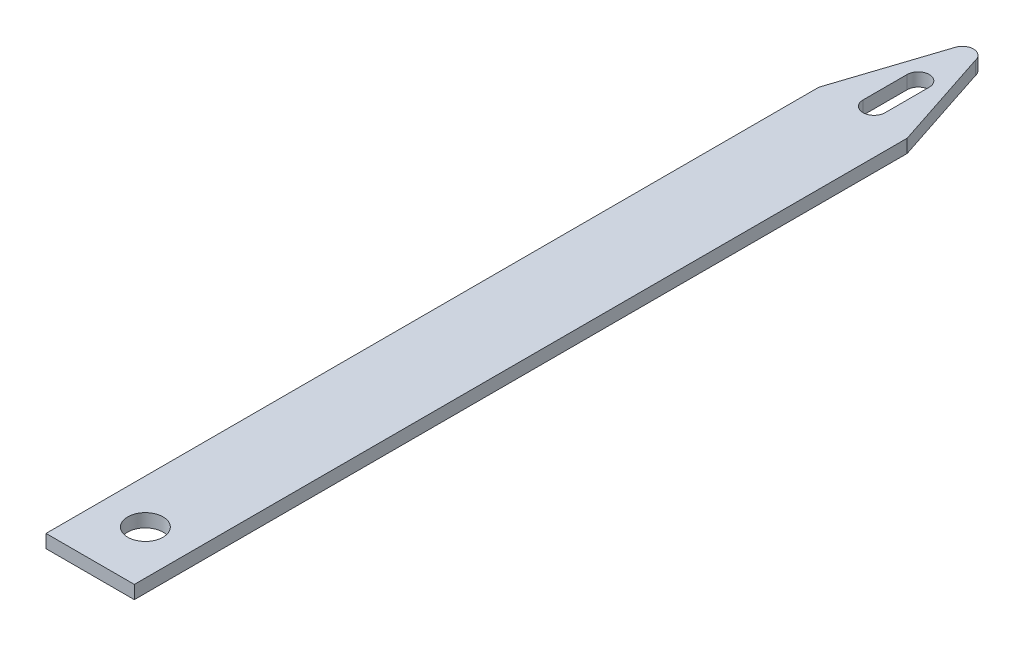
ISO-10303-21;
HEADER;
FILE_DESCRIPTION(('STEP AP214'),'2;1');
FILE_NAME('part.step','',(''),(''),'','','');
FILE_SCHEMA(('AUTOMOTIVE_DESIGN { 1 0 10303 214 1 1 1 1 }'));
ENDSEC;
DATA;
#1=APPLICATION_CONTEXT('core data for automotive mechanical design processes');
#2=APPLICATION_PROTOCOL_DEFINITION('international standard','automotive_design',2000,#1);
#3=PRODUCT_CONTEXT('',#1,'mechanical');
#4=PRODUCT('Part','Part','',(#3));
#5=PRODUCT_RELATED_PRODUCT_CATEGORY('part','',(#4));
#6=PRODUCT_DEFINITION_FORMATION('','',#4);
#7=PRODUCT_DEFINITION_CONTEXT('part definition',#1,'design');
#8=PRODUCT_DEFINITION('design','',#6,#7);
#9=PRODUCT_DEFINITION_SHAPE('','',#8);
#10=(LENGTH_UNIT() NAMED_UNIT(*) SI_UNIT(.MILLI.,.METRE.));
#11=(NAMED_UNIT(*) PLANE_ANGLE_UNIT() SI_UNIT($,.RADIAN.));
#12=(NAMED_UNIT(*) SI_UNIT($,.STERADIAN.) SOLID_ANGLE_UNIT());
#13=UNCERTAINTY_MEASURE_WITH_UNIT(LENGTH_MEASURE(1.E-05),#10,'distance_accuracy_value','');
#14=(GEOMETRIC_REPRESENTATION_CONTEXT(3) GLOBAL_UNCERTAINTY_ASSIGNED_CONTEXT((#13)) GLOBAL_UNIT_ASSIGNED_CONTEXT((#10,
#11,#12)) REPRESENTATION_CONTEXT('',''));
#15=CARTESIAN_POINT('',(0.,0.,0.));
#16=DIRECTION('',(0.,0.,1.));
#17=DIRECTION('',(1.,0.,0.));
#18=AXIS2_PLACEMENT_3D('',#15,#16,#17);
#19=CARTESIAN_POINT('',(0.,0.6,-20.));
#20=DIRECTION('',(0.,1.,0.));
#21=DIRECTION('',(0.,0.,1.));
#22=AXIS2_PLACEMENT_3D('',#19,#20,#21);
#23=PLANE('',#22);
#24=CARTESIAN_POINT('',(2.,0.6,-19.5));
#25=DIRECTION('',(0.,-1.,0.));
#26=DIRECTION('',(0.,0.,-1.));
#27=AXIS2_PLACEMENT_3D('',#24,#25,#26);
#28=CIRCLE('',#27,0.5);
#29=CARTESIAN_POINT('',(1.52483695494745,0.6,-19.6556280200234));
#30=VERTEX_POINT('',#29);
#31=CARTESIAN_POINT('',(2.4903123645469,0.6,-19.5979478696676));
#32=VERTEX_POINT('',#31);
#33=EDGE_CURVE('E229',#30,#32,#28,.T.);
#34=ORIENTED_EDGE('',*,*,#33,.F.);
#35=DIRECTION('',(-0.311256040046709,0.,0.950326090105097));
#36=VECTOR('',#35,1.);
#37=CARTESIAN_POINT('',(5.04754408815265,0.6,-30.4111478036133));
#38=LINE('',#37,#36);
#39=CARTESIAN_POINT('',(0.,0.6,-15.));
#40=VERTEX_POINT('',#39);
#41=EDGE_CURVE('E216',#30,#40,#38,.T.);
#42=ORIENTED_EDGE('',*,*,#41,.T.);
#43=DIRECTION('',(0.,0.,1.));
#44=VECTOR('',#43,1.);
#45=CARTESIAN_POINT('',(0.,0.6,-20.));
#46=LINE('',#45,#44);
#47=CARTESIAN_POINT('',(0.,0.6,20.));
#48=VERTEX_POINT('',#47);
#49=EDGE_CURVE('E12',#40,#48,#46,.T.);
#50=ORIENTED_EDGE('',*,*,#49,.T.);
#51=DIRECTION('',(-1.,0.,0.));
#52=VECTOR('',#51,1.);
#53=CARTESIAN_POINT('',(0.,0.6,20.));
#54=LINE('',#53,#52);
#55=CARTESIAN_POINT('',(4.,0.6,20.));
#56=VERTEX_POINT('',#55);
#57=EDGE_CURVE('E260',#56,#48,#54,.T.);
#58=ORIENTED_EDGE('',*,*,#57,.F.);
#59=DIRECTION('',(0.,0.,1.));
#60=VECTOR('',#59,1.);
#61=CARTESIAN_POINT('',(4.,0.6,-20.));
#62=LINE('',#61,#60);
#63=CARTESIAN_POINT('',(4.,0.6,-15.));
#64=VERTEX_POINT('',#63);
#65=EDGE_CURVE('E116',#64,#56,#62,.T.);
#66=ORIENTED_EDGE('',*,*,#65,.F.);
#67=DIRECTION('',(0.311954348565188,0.,0.95009709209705));
#68=VECTOR('',#67,1.);
#69=CARTESIAN_POINT('',(-1.05813179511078,0.6,-30.405190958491));
#70=LINE('',#69,#68);
#71=EDGE_CURVE('E234',#32,#64,#70,.T.);
#72=ORIENTED_EDGE('',*,*,#71,.F.);
#73=EDGE_LOOP('',(#34,#42,#50,#58,#66,#72));
#74=FACE_BOUND('',#73,.T.);
#75=CARTESIAN_POINT('',(2.,0.6,17.5));
#76=DIRECTION('',(0.,-1.,0.));
#77=DIRECTION('',(0.,0.,-1.));
#78=AXIS2_PLACEMENT_3D('',#75,#76,#77);
#79=CIRCLE('',#78,0.8);
#80=CARTESIAN_POINT('',(2.,0.6,16.7));
#81=VERTEX_POINT('',#80);
#82=EDGE_CURVE('E244',#81,#81,#79,.T.);
#83=ORIENTED_EDGE('',*,*,#82,.T.);
#84=EDGE_LOOP('',(#83));
#85=FACE_BOUND('',#84,.T.);
#86=DIRECTION('',(0.,0.,1.));
#87=VECTOR('',#86,1.);
#88=CARTESIAN_POINT('',(2.5,0.6,-31.4092962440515));
#89=LINE('',#88,#87);
#90=CARTESIAN_POINT('',(2.5,0.6,-17.5));
#91=VERTEX_POINT('',#90);
#92=CARTESIAN_POINT('',(2.5,0.6,-15.5));
#93=VERTEX_POINT('',#92);
#94=EDGE_CURVE('E210',#91,#93,#89,.T.);
#95=ORIENTED_EDGE('',*,*,#94,.T.);
#96=CARTESIAN_POINT('',(2.,0.6,-15.5));
#97=DIRECTION('',(0.,-1.,0.));
#98=DIRECTION('',(0.,0.,-1.));
#99=AXIS2_PLACEMENT_3D('',#96,#97,#98);
#100=CIRCLE('',#99,0.5);
#101=CARTESIAN_POINT('',(1.5,0.6,-15.5));
#102=VERTEX_POINT('',#101);
#103=EDGE_CURVE('E124',#93,#102,#100,.T.);
#104=ORIENTED_EDGE('',*,*,#103,.T.);
#105=DIRECTION('',(0.,0.,1.));
#106=VECTOR('',#105,1.);
#107=CARTESIAN_POINT('',(1.5,0.6,-31.4092962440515));
#108=LINE('',#107,#106);
#109=CARTESIAN_POINT('',(1.5,0.6,-17.5));
#110=VERTEX_POINT('',#109);
#111=EDGE_CURVE('E201',#110,#102,#108,.T.);
#112=ORIENTED_EDGE('',*,*,#111,.F.);
#113=CARTESIAN_POINT('',(2.,0.6,-17.5));
#114=DIRECTION('',(0.,-1.,0.));
#115=DIRECTION('',(0.,0.,-1.));
#116=AXIS2_PLACEMENT_3D('',#113,#114,#115);
#117=CIRCLE('',#116,0.5);
#118=EDGE_CURVE('E204',#110,#91,#117,.T.);
#119=ORIENTED_EDGE('',*,*,#118,.T.);
#120=EDGE_LOOP('',(#95,#104,#112,#119));
#121=FACE_BOUND('',#120,.T.);
#122=ADVANCED_FACE('F107',(#74,#85,#121),#23,.T.);
#123=CARTESIAN_POINT('',(0.,0.,-20.));
#124=DIRECTION('',(0.,-1.,0.));
#125=DIRECTION('',(0.,0.,-1.));
#126=AXIS2_PLACEMENT_3D('',#123,#124,#125);
#127=PLANE('',#126);
#128=DIRECTION('',(0.,0.,1.));
#129=VECTOR('',#128,1.);
#130=CARTESIAN_POINT('',(0.,0.,-20.));
#131=LINE('',#130,#129);
#132=CARTESIAN_POINT('',(0.,0.,-15.));
#133=VERTEX_POINT('',#132);
#134=CARTESIAN_POINT('',(0.,0.,20.));
#135=VERTEX_POINT('',#134);
#136=EDGE_CURVE('E111',#133,#135,#131,.T.);
#137=ORIENTED_EDGE('',*,*,#136,.F.);
#138=DIRECTION('',(-0.311256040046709,0.,0.950326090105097));
#139=VECTOR('',#138,1.);
#140=CARTESIAN_POINT('',(5.04754408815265,0.,-30.4111478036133));
#141=LINE('',#140,#139);
#142=CARTESIAN_POINT('',(1.52483695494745,0.,-19.6556280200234));
#143=VERTEX_POINT('',#142);
#144=EDGE_CURVE('E225',#143,#133,#141,.T.);
#145=ORIENTED_EDGE('',*,*,#144,.F.);
#146=CARTESIAN_POINT('',(2.,0.,-19.5));
#147=DIRECTION('',(0.,-1.,0.));
#148=DIRECTION('',(0.,0.,-1.));
#149=AXIS2_PLACEMENT_3D('',#146,#147,#148);
#150=CIRCLE('',#149,0.5);
#151=CARTESIAN_POINT('',(2.4903123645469,0.,-19.5979478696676));
#152=VERTEX_POINT('',#151);
#153=EDGE_CURVE('E230',#143,#152,#150,.T.);
#154=ORIENTED_EDGE('',*,*,#153,.T.);
#155=DIRECTION('',(0.311954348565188,0.,0.95009709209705));
#156=VECTOR('',#155,1.);
#157=CARTESIAN_POINT('',(-1.05813179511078,0.,-30.405190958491));
#158=LINE('',#157,#156);
#159=CARTESIAN_POINT('',(4.,0.,-15.));
#160=VERTEX_POINT('',#159);
#161=EDGE_CURVE('E233',#152,#160,#158,.T.);
#162=ORIENTED_EDGE('',*,*,#161,.T.);
#163=DIRECTION('',(0.,0.,1.));
#164=VECTOR('',#163,1.);
#165=CARTESIAN_POINT('',(4.,0.,-20.));
#166=LINE('',#165,#164);
#167=CARTESIAN_POINT('',(4.,0.,20.));
#168=VERTEX_POINT('',#167);
#169=EDGE_CURVE('E263',#160,#168,#166,.T.);
#170=ORIENTED_EDGE('',*,*,#169,.T.);
#171=DIRECTION('',(1.,0.,0.));
#172=VECTOR('',#171,1.);
#173=CARTESIAN_POINT('',(0.,0.,20.));
#174=LINE('',#173,#172);
#175=EDGE_CURVE('E254',#135,#168,#174,.T.);
#176=ORIENTED_EDGE('',*,*,#175,.F.);
#177=EDGE_LOOP('',(#137,#145,#154,#162,#170,#176));
#178=FACE_BOUND('',#177,.T.);
#179=CARTESIAN_POINT('',(2.,0.,17.5));
#180=DIRECTION('',(0.,-1.,0.));
#181=DIRECTION('',(0.,0.,-1.));
#182=AXIS2_PLACEMENT_3D('',#179,#180,#181);
#183=CIRCLE('',#182,0.8);
#184=CARTESIAN_POINT('',(2.,0.,16.7));
#185=VERTEX_POINT('',#184);
#186=EDGE_CURVE('E246',#185,#185,#183,.T.);
#187=ORIENTED_EDGE('',*,*,#186,.F.);
#188=EDGE_LOOP('',(#187));
#189=FACE_BOUND('',#188,.T.);
#190=DIRECTION('',(0.,0.,1.));
#191=VECTOR('',#190,1.);
#192=CARTESIAN_POINT('',(1.5,0.,-31.4092962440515));
#193=LINE('',#192,#191);
#194=CARTESIAN_POINT('',(1.5,0.,-17.5));
#195=VERTEX_POINT('',#194);
#196=CARTESIAN_POINT('',(1.5,0.,-15.5));
#197=VERTEX_POINT('',#196);
#198=EDGE_CURVE('E196',#195,#197,#193,.T.);
#199=ORIENTED_EDGE('',*,*,#198,.T.);
#200=CARTESIAN_POINT('',(2.,0.,-15.5));
#201=DIRECTION('',(0.,-1.,0.));
#202=DIRECTION('',(0.,0.,-1.));
#203=AXIS2_PLACEMENT_3D('',#200,#201,#202);
#204=CIRCLE('',#203,0.5);
#205=CARTESIAN_POINT('',(2.5,0.,-15.5));
#206=VERTEX_POINT('',#205);
#207=EDGE_CURVE('E192',#206,#197,#204,.T.);
#208=ORIENTED_EDGE('',*,*,#207,.F.);
#209=DIRECTION('',(0.,0.,1.));
#210=VECTOR('',#209,1.);
#211=CARTESIAN_POINT('',(2.5,0.,-31.4092962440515));
#212=LINE('',#211,#210);
#213=CARTESIAN_POINT('',(2.5,0.,-17.5));
#214=VERTEX_POINT('',#213);
#215=EDGE_CURVE('E184',#214,#206,#212,.T.);
#216=ORIENTED_EDGE('',*,*,#215,.F.);
#217=CARTESIAN_POINT('',(2.,0.,-17.5));
#218=DIRECTION('',(0.,-1.,0.));
#219=DIRECTION('',(0.,0.,-1.));
#220=AXIS2_PLACEMENT_3D('',#217,#218,#219);
#221=CIRCLE('',#220,0.5);
#222=EDGE_CURVE('E191',#195,#214,#221,.T.);
#223=ORIENTED_EDGE('',*,*,#222,.F.);
#224=EDGE_LOOP('',(#199,#208,#216,#223));
#225=FACE_BOUND('',#224,.T.);
#226=ADVANCED_FACE('F199',(#178,#189,#225),#127,.T.);
#227=CARTESIAN_POINT('',(0.,0.,-20.));
#228=DIRECTION('',(-1.,0.,0.));
#229=DIRECTION('',(0.,0.,1.));
#230=AXIS2_PLACEMENT_3D('',#227,#228,#229);
#231=PLANE('',#230);
#232=ORIENTED_EDGE('',*,*,#49,.F.);
#233=DIRECTION('',(0.,1.,0.));
#234=VECTOR('',#233,1.);
#235=CARTESIAN_POINT('',(0.,0.,-15.));
#236=LINE('',#235,#234);
#237=EDGE_CURVE('E223',#133,#40,#236,.T.);
#238=ORIENTED_EDGE('',*,*,#237,.F.);
#239=ORIENTED_EDGE('',*,*,#136,.T.);
#240=DIRECTION('',(0.,-1.,0.));
#241=VECTOR('',#240,1.);
#242=CARTESIAN_POINT('',(0.,0.,20.));
#243=LINE('',#242,#241);
#244=EDGE_CURVE('E249',#48,#135,#243,.T.);
#245=ORIENTED_EDGE('',*,*,#244,.F.);
#246=EDGE_LOOP('',(#232,#238,#239,#245));
#247=FACE_BOUND('',#246,.T.);
#248=ADVANCED_FACE('F109',(#247),#231,.T.);
#249=CARTESIAN_POINT('',(4.,0.,-20.));
#250=DIRECTION('',(1.,0.,0.));
#251=DIRECTION('',(0.,0.,-1.));
#252=AXIS2_PLACEMENT_3D('',#249,#250,#251);
#253=PLANE('',#252);
#254=DIRECTION('',(0.,1.,0.));
#255=VECTOR('',#254,1.);
#256=CARTESIAN_POINT('',(4.,0.,-15.));
#257=LINE('',#256,#255);
#258=EDGE_CURVE('E241',#160,#64,#257,.T.);
#259=ORIENTED_EDGE('',*,*,#258,.T.);
#260=ORIENTED_EDGE('',*,*,#65,.T.);
#261=DIRECTION('',(0.,1.,0.));
#262=VECTOR('',#261,1.);
#263=CARTESIAN_POINT('',(4.,0.,20.));
#264=LINE('',#263,#262);
#265=EDGE_CURVE('E257',#168,#56,#264,.T.);
#266=ORIENTED_EDGE('',*,*,#265,.F.);
#267=ORIENTED_EDGE('',*,*,#169,.F.);
#268=EDGE_LOOP('',(#259,#260,#266,#267));
#269=FACE_BOUND('',#268,.T.);
#270=ADVANCED_FACE('F292',(#269),#253,.T.);
#271=CARTESIAN_POINT('',(0.,0.6,20.));
#272=DIRECTION('',(0.,0.,-1.));
#273=DIRECTION('',(-1.,0.,0.));
#274=AXIS2_PLACEMENT_3D('',#271,#272,#273);
#275=PLANE('',#274);
#276=ORIENTED_EDGE('',*,*,#244,.T.);
#277=ORIENTED_EDGE('',*,*,#175,.T.);
#278=ORIENTED_EDGE('',*,*,#265,.T.);
#279=ORIENTED_EDGE('',*,*,#57,.T.);
#280=EDGE_LOOP('',(#276,#277,#278,#279));
#281=FACE_BOUND('',#280,.T.);
#282=ADVANCED_FACE('F276',(#281),#275,.F.);
#283=CARTESIAN_POINT('',(2.,0.,17.5));
#284=DIRECTION('',(0.,1.,0.));
#285=DIRECTION('',(0.,0.,1.));
#286=AXIS2_PLACEMENT_3D('',#283,#284,#285);
#287=CYLINDRICAL_SURFACE('',#286,0.8);
#288=ORIENTED_EDGE('',*,*,#186,.T.);
#289=EDGE_LOOP('',(#288));
#290=FACE_BOUND('',#289,.T.);
#291=ORIENTED_EDGE('',*,*,#82,.F.);
#292=EDGE_LOOP('',(#291));
#293=FACE_BOUND('',#292,.T.);
#294=ADVANCED_FACE('F299',(#290,#293),#287,.F.);
#295=CARTESIAN_POINT('',(-1.05813179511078,0.,-30.405190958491));
#296=DIRECTION('',(-0.950097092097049,0.,0.311954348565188));
#297=DIRECTION('',(0.311954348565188,0.,0.95009709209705));
#298=AXIS2_PLACEMENT_3D('',#295,#296,#297);
#299=PLANE('',#298);
#300=ORIENTED_EDGE('',*,*,#71,.T.);
#301=ORIENTED_EDGE('',*,*,#258,.F.);
#302=ORIENTED_EDGE('',*,*,#161,.F.);
#303=DIRECTION('',(0.,1.,0.));
#304=VECTOR('',#303,1.);
#305=CARTESIAN_POINT('',(2.4903123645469,0.,-19.5979478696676));
#306=LINE('',#305,#304);
#307=EDGE_CURVE('E237',#152,#32,#306,.T.);
#308=ORIENTED_EDGE('',*,*,#307,.T.);
#309=EDGE_LOOP('',(#300,#301,#302,#308));
#310=FACE_BOUND('',#309,.T.);
#311=ADVANCED_FACE('F290',(#310),#299,.F.);
#312=CARTESIAN_POINT('',(2.,0.,-19.5));
#313=DIRECTION('',(0.,1.,0.));
#314=DIRECTION('',(0.,0.,1.));
#315=AXIS2_PLACEMENT_3D('',#312,#313,#314);
#316=CYLINDRICAL_SURFACE('',#315,0.5);
#317=ORIENTED_EDGE('',*,*,#33,.T.);
#318=ORIENTED_EDGE('',*,*,#307,.F.);
#319=ORIENTED_EDGE('',*,*,#153,.F.);
#320=DIRECTION('',(0.,1.,0.));
#321=VECTOR('',#320,1.);
#322=CARTESIAN_POINT('',(1.52483695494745,0.,-19.6556280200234));
#323=LINE('',#322,#321);
#324=EDGE_CURVE('E220',#143,#30,#323,.T.);
#325=ORIENTED_EDGE('',*,*,#324,.T.);
#326=EDGE_LOOP('',(#317,#318,#319,#325));
#327=FACE_BOUND('',#326,.T.);
#328=ADVANCED_FACE('F288',(#327),#316,.T.);
#329=CARTESIAN_POINT('',(5.04754408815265,0.,-30.4111478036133));
#330=DIRECTION('',(-0.950326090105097,0.,-0.311256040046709));
#331=DIRECTION('',(-0.311256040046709,0.,0.950326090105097));
#332=AXIS2_PLACEMENT_3D('',#329,#330,#331);
#333=PLANE('',#332);
#334=ORIENTED_EDGE('',*,*,#41,.F.);
#335=ORIENTED_EDGE('',*,*,#324,.F.);
#336=ORIENTED_EDGE('',*,*,#144,.T.);
#337=ORIENTED_EDGE('',*,*,#237,.T.);
#338=EDGE_LOOP('',(#334,#335,#336,#337));
#339=FACE_BOUND('',#338,.T.);
#340=ADVANCED_FACE('F285',(#339),#333,.T.);
#341=CARTESIAN_POINT('',(2.,0.,-15.5));
#342=DIRECTION('',(0.,1.,0.));
#343=DIRECTION('',(0.,0.,1.));
#344=AXIS2_PLACEMENT_3D('',#341,#342,#343);
#345=CYLINDRICAL_SURFACE('',#344,0.5);
#346=ORIENTED_EDGE('',*,*,#103,.F.);
#347=DIRECTION('',(0.,1.,0.));
#348=VECTOR('',#347,1.);
#349=CARTESIAN_POINT('',(2.5,0.,-15.5));
#350=LINE('',#349,#348);
#351=EDGE_CURVE('E186',#206,#93,#350,.T.);
#352=ORIENTED_EDGE('',*,*,#351,.F.);
#353=ORIENTED_EDGE('',*,*,#207,.T.);
#354=DIRECTION('',(0.,1.,0.));
#355=VECTOR('',#354,1.);
#356=CARTESIAN_POINT('',(1.5,0.,-15.5));
#357=LINE('',#356,#355);
#358=EDGE_CURVE('E214',#197,#102,#357,.T.);
#359=ORIENTED_EDGE('',*,*,#358,.T.);
#360=EDGE_LOOP('',(#346,#352,#353,#359));
#361=FACE_BOUND('',#360,.T.);
#362=ADVANCED_FACE('F194',(#361),#345,.F.);
#363=CARTESIAN_POINT('',(1.5,0.,-31.4092962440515));
#364=DIRECTION('',(-1.,0.,0.));
#365=DIRECTION('',(0.,0.,1.));
#366=AXIS2_PLACEMENT_3D('',#363,#364,#365);
#367=PLANE('',#366);
#368=ORIENTED_EDGE('',*,*,#111,.T.);
#369=ORIENTED_EDGE('',*,*,#358,.F.);
#370=ORIENTED_EDGE('',*,*,#198,.F.);
#371=DIRECTION('',(0.,1.,0.));
#372=VECTOR('',#371,1.);
#373=CARTESIAN_POINT('',(1.5,0.,-17.5));
#374=LINE('',#373,#372);
#375=EDGE_CURVE('E217',#195,#110,#374,.T.);
#376=ORIENTED_EDGE('',*,*,#375,.T.);
#377=EDGE_LOOP('',(#368,#369,#370,#376));
#378=FACE_BOUND('',#377,.T.);
#379=ADVANCED_FACE('F318',(#378),#367,.F.);
#380=CARTESIAN_POINT('',(2.,0.,-17.5));
#381=DIRECTION('',(0.,1.,0.));
#382=DIRECTION('',(0.,0.,1.));
#383=AXIS2_PLACEMENT_3D('',#380,#381,#382);
#384=CYLINDRICAL_SURFACE('',#383,0.5);
#385=ORIENTED_EDGE('',*,*,#118,.F.);
#386=ORIENTED_EDGE('',*,*,#375,.F.);
#387=ORIENTED_EDGE('',*,*,#222,.T.);
#388=DIRECTION('',(0.,1.,0.));
#389=VECTOR('',#388,1.);
#390=CARTESIAN_POINT('',(2.5,0.,-17.5));
#391=LINE('',#390,#389);
#392=EDGE_CURVE('E132',#214,#91,#391,.T.);
#393=ORIENTED_EDGE('',*,*,#392,.T.);
#394=EDGE_LOOP('',(#385,#386,#387,#393));
#395=FACE_BOUND('',#394,.T.);
#396=ADVANCED_FACE('F321',(#395),#384,.F.);
#397=CARTESIAN_POINT('',(2.5,0.,-31.4092962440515));
#398=DIRECTION('',(-1.,0.,0.));
#399=DIRECTION('',(0.,0.,1.));
#400=AXIS2_PLACEMENT_3D('',#397,#398,#399);
#401=PLANE('',#400);
#402=ORIENTED_EDGE('',*,*,#94,.F.);
#403=ORIENTED_EDGE('',*,*,#392,.F.);
#404=ORIENTED_EDGE('',*,*,#215,.T.);
#405=ORIENTED_EDGE('',*,*,#351,.T.);
#406=EDGE_LOOP('',(#402,#403,#404,#405));
#407=FACE_BOUND('',#406,.T.);
#408=ADVANCED_FACE('F185',(#407),#401,.T.);
#409=CLOSED_SHELL('',(#122,#226,#248,#270,#282,#294,#311,#328,#340,#362,#379,#396,#408));
#410=MANIFOLD_SOLID_BREP('B2',#409);
#411=ADVANCED_BREP_SHAPE_REPRESENTATION('',(#18,#410),#14);
#412=SHAPE_DEFINITION_REPRESENTATION(#9,#411);
ENDSEC;
END-ISO-10303-21;
